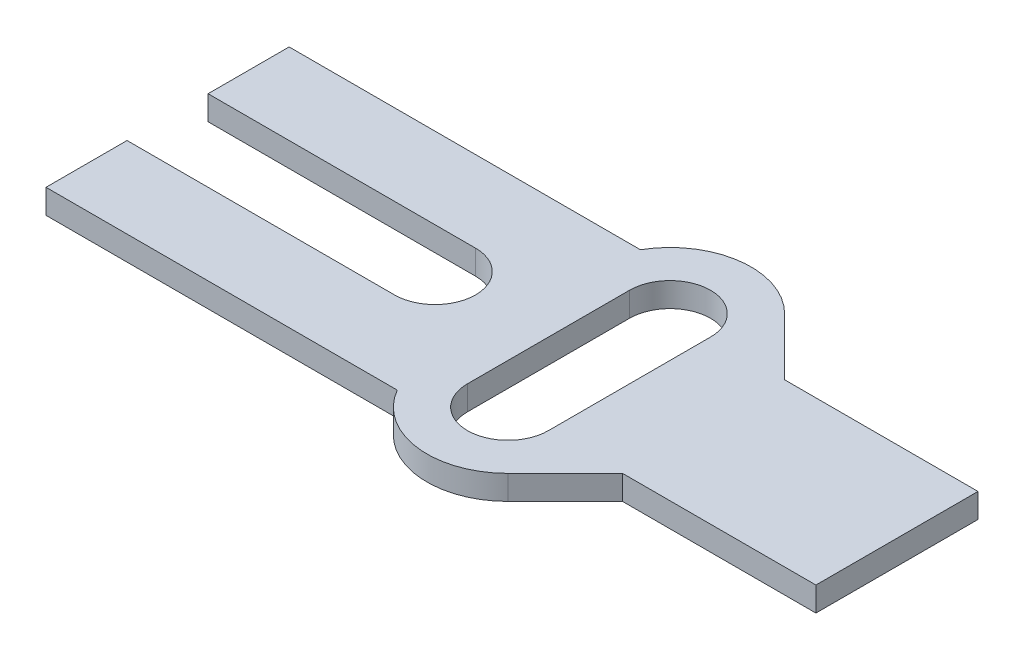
ISO-10303-21;
HEADER;
FILE_DESCRIPTION(('STEP AP214'),'2;1');
FILE_NAME('part.step','',(''),(''),'','','');
FILE_SCHEMA(('AUTOMOTIVE_DESIGN { 1 0 10303 214 1 1 1 1 }'));
ENDSEC;
DATA;
#1=APPLICATION_CONTEXT('core data for automotive mechanical design processes');
#2=APPLICATION_PROTOCOL_DEFINITION('international standard','automotive_design',2000,#1);
#3=PRODUCT_CONTEXT('',#1,'mechanical');
#4=PRODUCT('Part','Part','',(#3));
#5=PRODUCT_RELATED_PRODUCT_CATEGORY('part','',(#4));
#6=PRODUCT_DEFINITION_FORMATION('','',#4);
#7=PRODUCT_DEFINITION_CONTEXT('part definition',#1,'design');
#8=PRODUCT_DEFINITION('design','',#6,#7);
#9=PRODUCT_DEFINITION_SHAPE('','',#8);
#10=(LENGTH_UNIT() NAMED_UNIT(*) SI_UNIT(.MILLI.,.METRE.));
#11=(NAMED_UNIT(*) PLANE_ANGLE_UNIT() SI_UNIT($,.RADIAN.));
#12=(NAMED_UNIT(*) SI_UNIT($,.STERADIAN.) SOLID_ANGLE_UNIT());
#13=UNCERTAINTY_MEASURE_WITH_UNIT(LENGTH_MEASURE(1.E-05),#10,'distance_accuracy_value','');
#14=(GEOMETRIC_REPRESENTATION_CONTEXT(3) GLOBAL_UNCERTAINTY_ASSIGNED_CONTEXT((#13)) GLOBAL_UNIT_ASSIGNED_CONTEXT((#10,
#11,#12)) REPRESENTATION_CONTEXT('',''));
#15=CARTESIAN_POINT('',(0.,0.,0.));
#16=DIRECTION('',(0.,0.,1.));
#17=DIRECTION('',(1.,0.,0.));
#18=AXIS2_PLACEMENT_3D('',#15,#16,#17);
#19=CARTESIAN_POINT('',(33.,3.,-15.));
#20=DIRECTION('',(0.,1.,0.));
#21=DIRECTION('',(0.,0.,1.));
#22=AXIS2_PLACEMENT_3D('',#19,#20,#21);
#23=PLANE('',#22);
#24=DIRECTION('',(0.,0.,1.));
#25=VECTOR('',#24,1.);
#26=CARTESIAN_POINT('',(0.,3.,0.));
#27=LINE('',#26,#25);
#28=CARTESIAN_POINT('',(0.,3.,-10.));
#29=VERTEX_POINT('',#28);
#30=CARTESIAN_POINT('',(0.,3.,0.));
#31=VERTEX_POINT('',#30);
#32=EDGE_CURVE('E219',#29,#31,#27,.T.);
#33=ORIENTED_EDGE('',*,*,#32,.T.);
#34=DIRECTION('',(1.,0.,0.));
#35=VECTOR('',#34,1.);
#36=CARTESIAN_POINT('',(0.,3.,0.));
#37=LINE('',#36,#35);
#38=CARTESIAN_POINT('',(43.3397459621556,3.,0.));
#39=VERTEX_POINT('',#38);
#40=EDGE_CURVE('E222',#31,#39,#37,.T.);
#41=ORIENTED_EDGE('',*,*,#40,.T.);
#42=CARTESIAN_POINT('',(52.,3.,-5.));
#43=DIRECTION('',(0.,1.,0.));
#44=DIRECTION('',(0.,0.,1.));
#45=AXIS2_PLACEMENT_3D('',#42,#43,#44);
#46=CIRCLE('',#45,10.);
#47=CARTESIAN_POINT('',(59.0710678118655,3.,2.07106781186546));
#48=VERTEX_POINT('',#47);
#49=EDGE_CURVE('E224',#39,#48,#46,.T.);
#50=ORIENTED_EDGE('',*,*,#49,.T.);
#51=DIRECTION('',(0.707106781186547,0.,-0.707106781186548));
#52=VECTOR('',#51,1.);
#53=CARTESIAN_POINT('',(59.0710678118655,3.,2.07106781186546));
#54=LINE('',#53,#52);
#55=CARTESIAN_POINT('',(66.1421356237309,3.,-5.));
#56=VERTEX_POINT('',#55);
#57=EDGE_CURVE('E226',#48,#56,#54,.T.);
#58=ORIENTED_EDGE('',*,*,#57,.T.);
#59=DIRECTION('',(1.,0.,0.));
#60=VECTOR('',#59,1.);
#61=CARTESIAN_POINT('',(66.1421356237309,3.,-5.));
#62=LINE('',#61,#60);
#63=CARTESIAN_POINT('',(90.,3.,-5.));
#64=VERTEX_POINT('',#63);
#65=EDGE_CURVE('E228',#56,#64,#62,.T.);
#66=ORIENTED_EDGE('',*,*,#65,.T.);
#67=DIRECTION('',(0.,0.,-1.));
#68=VECTOR('',#67,1.);
#69=CARTESIAN_POINT('',(90.,3.,-5.));
#70=LINE('',#69,#68);
#71=CARTESIAN_POINT('',(90.,3.,-25.));
#72=VERTEX_POINT('',#71);
#73=EDGE_CURVE('E230',#64,#72,#70,.T.);
#74=ORIENTED_EDGE('',*,*,#73,.T.);
#75=DIRECTION('',(-1.,0.,0.));
#76=VECTOR('',#75,1.);
#77=CARTESIAN_POINT('',(66.1421356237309,3.,-25.));
#78=LINE('',#77,#76);
#79=CARTESIAN_POINT('',(66.1421356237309,3.,-25.));
#80=VERTEX_POINT('',#79);
#81=EDGE_CURVE('E232',#72,#80,#78,.T.);
#82=ORIENTED_EDGE('',*,*,#81,.T.);
#83=DIRECTION('',(-0.707106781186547,0.,-0.707106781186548));
#84=VECTOR('',#83,1.);
#85=CARTESIAN_POINT('',(59.0710678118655,3.,-32.0710678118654));
#86=LINE('',#85,#84);
#87=CARTESIAN_POINT('',(59.0710678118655,3.,-32.0710678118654));
#88=VERTEX_POINT('',#87);
#89=EDGE_CURVE('E234',#80,#88,#86,.T.);
#90=ORIENTED_EDGE('',*,*,#89,.T.);
#91=CARTESIAN_POINT('',(52.,3.,-25.));
#92=DIRECTION('',(0.,1.,0.));
#93=DIRECTION('',(0.,0.,1.));
#94=AXIS2_PLACEMENT_3D('',#91,#92,#93);
#95=CIRCLE('',#94,9.99999999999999);
#96=CARTESIAN_POINT('',(43.3397459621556,3.,-30.));
#97=VERTEX_POINT('',#96);
#98=EDGE_CURVE('E236',#88,#97,#95,.T.);
#99=ORIENTED_EDGE('',*,*,#98,.T.);
#100=DIRECTION('',(-1.,0.,0.));
#101=VECTOR('',#100,1.);
#102=CARTESIAN_POINT('',(0.,3.,-30.));
#103=LINE('',#102,#101);
#104=CARTESIAN_POINT('',(0.,3.,-30.));
#105=VERTEX_POINT('',#104);
#106=EDGE_CURVE('E238',#97,#105,#103,.T.);
#107=ORIENTED_EDGE('',*,*,#106,.T.);
#108=DIRECTION('',(0.,0.,1.));
#109=VECTOR('',#108,1.);
#110=CARTESIAN_POINT('',(0.,3.,-20.));
#111=LINE('',#110,#109);
#112=CARTESIAN_POINT('',(0.,3.,-20.));
#113=VERTEX_POINT('',#112);
#114=EDGE_CURVE('E240',#105,#113,#111,.T.);
#115=ORIENTED_EDGE('',*,*,#114,.T.);
#116=DIRECTION('',(1.,0.,0.));
#117=VECTOR('',#116,1.);
#118=CARTESIAN_POINT('',(0.,3.,-20.));
#119=LINE('',#118,#117);
#120=CARTESIAN_POINT('',(33.,3.,-20.));
#121=VERTEX_POINT('',#120);
#122=EDGE_CURVE('E242',#113,#121,#119,.T.);
#123=ORIENTED_EDGE('',*,*,#122,.T.);
#124=CARTESIAN_POINT('',(33.,3.,-15.));
#125=DIRECTION('',(0.,-1.,0.));
#126=DIRECTION('',(0.,0.,1.));
#127=AXIS2_PLACEMENT_3D('',#124,#125,#126);
#128=CIRCLE('',#127,5.);
#129=CARTESIAN_POINT('',(33.,3.,-10.));
#130=VERTEX_POINT('',#129);
#131=EDGE_CURVE('E244',#121,#130,#128,.T.);
#132=ORIENTED_EDGE('',*,*,#131,.T.);
#133=DIRECTION('',(-1.,0.,0.));
#134=VECTOR('',#133,1.);
#135=CARTESIAN_POINT('',(0.,3.,-10.));
#136=LINE('',#135,#134);
#137=EDGE_CURVE('E246',#130,#29,#136,.T.);
#138=ORIENTED_EDGE('',*,*,#137,.T.);
#139=EDGE_LOOP('',(#33,#41,#50,#58,#66,#74,#82,#90,#99,#107,#115,#123,#132,#138));
#140=FACE_BOUND('',#139,.T.);
#141=DIRECTION('',(0.,0.,1.));
#142=VECTOR('',#141,1.);
#143=CARTESIAN_POINT('',(47.,3.,-25.));
#144=LINE('',#143,#142);
#145=CARTESIAN_POINT('',(47.,3.,-25.));
#146=VERTEX_POINT('',#145);
#147=CARTESIAN_POINT('',(47.,3.,-5.));
#148=VERTEX_POINT('',#147);
#149=EDGE_CURVE('E181',#146,#148,#144,.T.);
#150=ORIENTED_EDGE('',*,*,#149,.F.);
#151=CARTESIAN_POINT('',(52.,3.,-25.));
#152=DIRECTION('',(0.,1.,0.));
#153=DIRECTION('',(0.,0.,1.));
#154=AXIS2_PLACEMENT_3D('',#151,#152,#153);
#155=CIRCLE('',#154,5.);
#156=CARTESIAN_POINT('',(57.,3.,-25.));
#157=VERTEX_POINT('',#156);
#158=EDGE_CURVE('E170',#157,#146,#155,.T.);
#159=ORIENTED_EDGE('',*,*,#158,.F.);
#160=DIRECTION('',(0.,0.,-1.));
#161=VECTOR('',#160,1.);
#162=CARTESIAN_POINT('',(57.,3.,-25.));
#163=LINE('',#162,#161);
#164=CARTESIAN_POINT('',(57.,3.,-5.));
#165=VERTEX_POINT('',#164);
#166=EDGE_CURVE('E185',#165,#157,#163,.T.);
#167=ORIENTED_EDGE('',*,*,#166,.F.);
#168=CARTESIAN_POINT('',(52.,3.,-5.));
#169=DIRECTION('',(0.,1.,0.));
#170=DIRECTION('',(0.,0.,1.));
#171=AXIS2_PLACEMENT_3D('',#168,#169,#170);
#172=CIRCLE('',#171,5.);
#173=EDGE_CURVE('E183',#148,#165,#172,.T.);
#174=ORIENTED_EDGE('',*,*,#173,.F.);
#175=EDGE_LOOP('',(#150,#159,#167,#174));
#176=FACE_BOUND('',#175,.T.);
#177=ADVANCED_FACE('F30',(#140,#176),#23,.T.);
#178=CARTESIAN_POINT('',(33.,0.,-15.));
#179=DIRECTION('',(0.,1.,0.));
#180=DIRECTION('',(0.,0.,1.));
#181=AXIS2_PLACEMENT_3D('',#178,#179,#180);
#182=PLANE('',#181);
#183=DIRECTION('',(0.,0.,1.));
#184=VECTOR('',#183,1.);
#185=CARTESIAN_POINT('',(0.,0.,0.));
#186=LINE('',#185,#184);
#187=CARTESIAN_POINT('',(0.,0.,-10.));
#188=VERTEX_POINT('',#187);
#189=CARTESIAN_POINT('',(0.,0.,0.));
#190=VERTEX_POINT('',#189);
#191=EDGE_CURVE('E171',#188,#190,#186,.T.);
#192=ORIENTED_EDGE('',*,*,#191,.F.);
#193=DIRECTION('',(-1.,0.,0.));
#194=VECTOR('',#193,1.);
#195=CARTESIAN_POINT('',(0.,0.,-10.));
#196=LINE('',#195,#194);
#197=CARTESIAN_POINT('',(33.,0.,-10.));
#198=VERTEX_POINT('',#197);
#199=EDGE_CURVE('E217',#198,#188,#196,.T.);
#200=ORIENTED_EDGE('',*,*,#199,.F.);
#201=CARTESIAN_POINT('',(33.,0.,-15.));
#202=DIRECTION('',(0.,-1.,0.));
#203=DIRECTION('',(0.,0.,1.));
#204=AXIS2_PLACEMENT_3D('',#201,#202,#203);
#205=CIRCLE('',#204,5.);
#206=CARTESIAN_POINT('',(33.,0.,-20.));
#207=VERTEX_POINT('',#206);
#208=EDGE_CURVE('E215',#207,#198,#205,.T.);
#209=ORIENTED_EDGE('',*,*,#208,.F.);
#210=DIRECTION('',(1.,0.,0.));
#211=VECTOR('',#210,1.);
#212=CARTESIAN_POINT('',(0.,0.,-20.));
#213=LINE('',#212,#211);
#214=CARTESIAN_POINT('',(0.,0.,-20.));
#215=VERTEX_POINT('',#214);
#216=EDGE_CURVE('E213',#215,#207,#213,.T.);
#217=ORIENTED_EDGE('',*,*,#216,.F.);
#218=DIRECTION('',(0.,0.,1.));
#219=VECTOR('',#218,1.);
#220=CARTESIAN_POINT('',(0.,0.,-20.));
#221=LINE('',#220,#219);
#222=CARTESIAN_POINT('',(0.,0.,-30.));
#223=VERTEX_POINT('',#222);
#224=EDGE_CURVE('E211',#223,#215,#221,.T.);
#225=ORIENTED_EDGE('',*,*,#224,.F.);
#226=DIRECTION('',(-1.,0.,0.));
#227=VECTOR('',#226,1.);
#228=CARTESIAN_POINT('',(0.,0.,-30.));
#229=LINE('',#228,#227);
#230=CARTESIAN_POINT('',(43.3397459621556,0.,-30.));
#231=VERTEX_POINT('',#230);
#232=EDGE_CURVE('E209',#231,#223,#229,.T.);
#233=ORIENTED_EDGE('',*,*,#232,.F.);
#234=CARTESIAN_POINT('',(52.,0.,-25.));
#235=DIRECTION('',(0.,1.,0.));
#236=DIRECTION('',(0.,0.,1.));
#237=AXIS2_PLACEMENT_3D('',#234,#235,#236);
#238=CIRCLE('',#237,9.99999999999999);
#239=CARTESIAN_POINT('',(59.0710678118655,0.,-32.0710678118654));
#240=VERTEX_POINT('',#239);
#241=EDGE_CURVE('E207',#240,#231,#238,.T.);
#242=ORIENTED_EDGE('',*,*,#241,.F.);
#243=DIRECTION('',(-0.707106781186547,0.,-0.707106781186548));
#244=VECTOR('',#243,1.);
#245=CARTESIAN_POINT('',(59.0710678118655,0.,-32.0710678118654));
#246=LINE('',#245,#244);
#247=CARTESIAN_POINT('',(66.1421356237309,0.,-25.));
#248=VERTEX_POINT('',#247);
#249=EDGE_CURVE('E205',#248,#240,#246,.T.);
#250=ORIENTED_EDGE('',*,*,#249,.F.);
#251=DIRECTION('',(-1.,0.,0.));
#252=VECTOR('',#251,1.);
#253=CARTESIAN_POINT('',(66.1421356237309,0.,-25.));
#254=LINE('',#253,#252);
#255=CARTESIAN_POINT('',(90.,0.,-25.));
#256=VERTEX_POINT('',#255);
#257=EDGE_CURVE('E203',#256,#248,#254,.T.);
#258=ORIENTED_EDGE('',*,*,#257,.F.);
#259=DIRECTION('',(0.,0.,-1.));
#260=VECTOR('',#259,1.);
#261=CARTESIAN_POINT('',(90.,0.,-5.));
#262=LINE('',#261,#260);
#263=CARTESIAN_POINT('',(90.,0.,-5.));
#264=VERTEX_POINT('',#263);
#265=EDGE_CURVE('E201',#264,#256,#262,.T.);
#266=ORIENTED_EDGE('',*,*,#265,.F.);
#267=DIRECTION('',(1.,0.,0.));
#268=VECTOR('',#267,1.);
#269=CARTESIAN_POINT('',(66.1421356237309,0.,-5.));
#270=LINE('',#269,#268);
#271=CARTESIAN_POINT('',(66.1421356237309,0.,-5.));
#272=VERTEX_POINT('',#271);
#273=EDGE_CURVE('E199',#272,#264,#270,.T.);
#274=ORIENTED_EDGE('',*,*,#273,.F.);
#275=DIRECTION('',(0.707106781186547,0.,-0.707106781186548));
#276=VECTOR('',#275,1.);
#277=CARTESIAN_POINT('',(59.0710678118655,0.,2.07106781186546));
#278=LINE('',#277,#276);
#279=CARTESIAN_POINT('',(59.0710678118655,0.,2.07106781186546));
#280=VERTEX_POINT('',#279);
#281=EDGE_CURVE('E197',#280,#272,#278,.T.);
#282=ORIENTED_EDGE('',*,*,#281,.F.);
#283=CARTESIAN_POINT('',(52.,0.,-5.));
#284=DIRECTION('',(0.,1.,0.));
#285=DIRECTION('',(0.,0.,1.));
#286=AXIS2_PLACEMENT_3D('',#283,#284,#285);
#287=CIRCLE('',#286,10.);
#288=CARTESIAN_POINT('',(43.3397459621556,0.,0.));
#289=VERTEX_POINT('',#288);
#290=EDGE_CURVE('E195',#289,#280,#287,.T.);
#291=ORIENTED_EDGE('',*,*,#290,.F.);
#292=DIRECTION('',(1.,0.,0.));
#293=VECTOR('',#292,1.);
#294=CARTESIAN_POINT('',(0.,0.,0.));
#295=LINE('',#294,#293);
#296=EDGE_CURVE('E193',#190,#289,#295,.T.);
#297=ORIENTED_EDGE('',*,*,#296,.F.);
#298=EDGE_LOOP('',(#192,#200,#209,#217,#225,#233,#242,#250,#258,#266,#274,#282,#291,#297));
#299=FACE_BOUND('',#298,.T.);
#300=CARTESIAN_POINT('',(52.,0.,-25.));
#301=DIRECTION('',(0.,1.,0.));
#302=DIRECTION('',(0.,0.,1.));
#303=AXIS2_PLACEMENT_3D('',#300,#301,#302);
#304=CIRCLE('',#303,5.);
#305=CARTESIAN_POINT('',(57.,0.,-25.));
#306=VERTEX_POINT('',#305);
#307=CARTESIAN_POINT('',(47.,0.,-25.));
#308=VERTEX_POINT('',#307);
#309=EDGE_CURVE('E53',#306,#308,#304,.T.);
#310=ORIENTED_EDGE('',*,*,#309,.T.);
#311=DIRECTION('',(0.,0.,1.));
#312=VECTOR('',#311,1.);
#313=CARTESIAN_POINT('',(47.,0.,-25.));
#314=LINE('',#313,#312);
#315=CARTESIAN_POINT('',(47.,0.,-5.));
#316=VERTEX_POINT('',#315);
#317=EDGE_CURVE('E157',#308,#316,#314,.T.);
#318=ORIENTED_EDGE('',*,*,#317,.T.);
#319=CARTESIAN_POINT('',(52.,0.,-5.));
#320=DIRECTION('',(0.,1.,0.));
#321=DIRECTION('',(0.,0.,1.));
#322=AXIS2_PLACEMENT_3D('',#319,#320,#321);
#323=CIRCLE('',#322,5.);
#324=CARTESIAN_POINT('',(57.,0.,-5.));
#325=VERTEX_POINT('',#324);
#326=EDGE_CURVE('E166',#316,#325,#323,.T.);
#327=ORIENTED_EDGE('',*,*,#326,.T.);
#328=DIRECTION('',(0.,0.,-1.));
#329=VECTOR('',#328,1.);
#330=CARTESIAN_POINT('',(57.,0.,-25.));
#331=LINE('',#330,#329);
#332=EDGE_CURVE('E175',#325,#306,#331,.T.);
#333=ORIENTED_EDGE('',*,*,#332,.T.);
#334=EDGE_LOOP('',(#310,#318,#327,#333));
#335=FACE_BOUND('',#334,.T.);
#336=ADVANCED_FACE('F174',(#299,#335),#182,.F.);
#337=CARTESIAN_POINT('',(0.,3.,0.));
#338=DIRECTION('',(1.,0.,0.));
#339=DIRECTION('',(0.,0.,-1.));
#340=AXIS2_PLACEMENT_3D('',#337,#338,#339);
#341=PLANE('',#340);
#342=ORIENTED_EDGE('',*,*,#191,.T.);
#343=DIRECTION('',(0.,-1.,0.));
#344=VECTOR('',#343,1.);
#345=CARTESIAN_POINT('',(0.,3.,0.));
#346=LINE('',#345,#344);
#347=EDGE_CURVE('E11',#31,#190,#346,.T.);
#348=ORIENTED_EDGE('',*,*,#347,.F.);
#349=ORIENTED_EDGE('',*,*,#32,.F.);
#350=DIRECTION('',(0.,-1.,0.));
#351=VECTOR('',#350,1.);
#352=CARTESIAN_POINT('',(0.,3.,-10.));
#353=LINE('',#352,#351);
#354=EDGE_CURVE('E248',#29,#188,#353,.T.);
#355=ORIENTED_EDGE('',*,*,#354,.T.);
#356=EDGE_LOOP('',(#342,#348,#349,#355));
#357=FACE_BOUND('',#356,.T.);
#358=ADVANCED_FACE('F32',(#357),#341,.F.);
#359=CARTESIAN_POINT('',(0.,3.,0.));
#360=DIRECTION('',(0.,0.,-1.));
#361=DIRECTION('',(-1.,0.,0.));
#362=AXIS2_PLACEMENT_3D('',#359,#360,#361);
#363=PLANE('',#362);
#364=ORIENTED_EDGE('',*,*,#296,.T.);
#365=DIRECTION('',(0.,-1.,0.));
#366=VECTOR('',#365,1.);
#367=CARTESIAN_POINT('',(43.3397459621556,3.,0.));
#368=LINE('',#367,#366);
#369=EDGE_CURVE('E38',#39,#289,#368,.T.);
#370=ORIENTED_EDGE('',*,*,#369,.F.);
#371=ORIENTED_EDGE('',*,*,#40,.F.);
#372=ORIENTED_EDGE('',*,*,#347,.T.);
#373=EDGE_LOOP('',(#364,#370,#371,#372));
#374=FACE_BOUND('',#373,.T.);
#375=ADVANCED_FACE('F310',(#374),#363,.F.);
#376=CARTESIAN_POINT('',(52.,3.,-5.));
#377=DIRECTION('',(0.,-1.,0.));
#378=DIRECTION('',(0.,0.,-1.));
#379=AXIS2_PLACEMENT_3D('',#376,#377,#378);
#380=CYLINDRICAL_SURFACE('',#379,10.);
#381=ORIENTED_EDGE('',*,*,#290,.T.);
#382=DIRECTION('',(0.,-1.,0.));
#383=VECTOR('',#382,1.);
#384=CARTESIAN_POINT('',(59.0710678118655,3.,2.07106781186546));
#385=LINE('',#384,#383);
#386=EDGE_CURVE('E281',#48,#280,#385,.T.);
#387=ORIENTED_EDGE('',*,*,#386,.F.);
#388=ORIENTED_EDGE('',*,*,#49,.F.);
#389=ORIENTED_EDGE('',*,*,#369,.T.);
#390=EDGE_LOOP('',(#381,#387,#388,#389));
#391=FACE_BOUND('',#390,.T.);
#392=ADVANCED_FACE('F288',(#391),#380,.T.);
#393=CARTESIAN_POINT('',(59.0710678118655,3.,2.07106781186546));
#394=DIRECTION('',(-0.707106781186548,0.,-0.707106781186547));
#395=DIRECTION('',(-0.707106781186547,0.,0.707106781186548));
#396=AXIS2_PLACEMENT_3D('',#393,#394,#395);
#397=PLANE('',#396);
#398=ORIENTED_EDGE('',*,*,#281,.T.);
#399=DIRECTION('',(0.,-1.,0.));
#400=VECTOR('',#399,1.);
#401=CARTESIAN_POINT('',(66.1421356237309,3.,-5.));
#402=LINE('',#401,#400);
#403=EDGE_CURVE('E278',#56,#272,#402,.T.);
#404=ORIENTED_EDGE('',*,*,#403,.F.);
#405=ORIENTED_EDGE('',*,*,#57,.F.);
#406=ORIENTED_EDGE('',*,*,#386,.T.);
#407=EDGE_LOOP('',(#398,#404,#405,#406));
#408=FACE_BOUND('',#407,.T.);
#409=ADVANCED_FACE('F298',(#408),#397,.F.);
#410=CARTESIAN_POINT('',(66.1421356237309,3.,-5.));
#411=DIRECTION('',(0.,0.,-1.));
#412=DIRECTION('',(-1.,0.,0.));
#413=AXIS2_PLACEMENT_3D('',#410,#411,#412);
#414=PLANE('',#413);
#415=ORIENTED_EDGE('',*,*,#273,.T.);
#416=DIRECTION('',(0.,-1.,0.));
#417=VECTOR('',#416,1.);
#418=CARTESIAN_POINT('',(90.,3.,-5.));
#419=LINE('',#418,#417);
#420=EDGE_CURVE('E275',#64,#264,#419,.T.);
#421=ORIENTED_EDGE('',*,*,#420,.F.);
#422=ORIENTED_EDGE('',*,*,#65,.F.);
#423=ORIENTED_EDGE('',*,*,#403,.T.);
#424=EDGE_LOOP('',(#415,#421,#422,#423));
#425=FACE_BOUND('',#424,.T.);
#426=ADVANCED_FACE('F302',(#425),#414,.F.);
#427=CARTESIAN_POINT('',(90.,3.,-5.));
#428=DIRECTION('',(-1.,0.,0.));
#429=DIRECTION('',(0.,0.,1.));
#430=AXIS2_PLACEMENT_3D('',#427,#428,#429);
#431=PLANE('',#430);
#432=ORIENTED_EDGE('',*,*,#265,.T.);
#433=DIRECTION('',(0.,-1.,0.));
#434=VECTOR('',#433,1.);
#435=CARTESIAN_POINT('',(90.,3.,-25.));
#436=LINE('',#435,#434);
#437=EDGE_CURVE('E272',#72,#256,#436,.T.);
#438=ORIENTED_EDGE('',*,*,#437,.F.);
#439=ORIENTED_EDGE('',*,*,#73,.F.);
#440=ORIENTED_EDGE('',*,*,#420,.T.);
#441=EDGE_LOOP('',(#432,#438,#439,#440));
#442=FACE_BOUND('',#441,.T.);
#443=ADVANCED_FACE('F353',(#442),#431,.F.);
#444=CARTESIAN_POINT('',(66.1421356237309,3.,-25.));
#445=DIRECTION('',(0.,0.,1.));
#446=DIRECTION('',(1.,0.,0.));
#447=AXIS2_PLACEMENT_3D('',#444,#445,#446);
#448=PLANE('',#447);
#449=ORIENTED_EDGE('',*,*,#257,.T.);
#450=DIRECTION('',(0.,-1.,0.));
#451=VECTOR('',#450,1.);
#452=CARTESIAN_POINT('',(66.1421356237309,3.,-25.));
#453=LINE('',#452,#451);
#454=EDGE_CURVE('E269',#80,#248,#453,.T.);
#455=ORIENTED_EDGE('',*,*,#454,.F.);
#456=ORIENTED_EDGE('',*,*,#81,.F.);
#457=ORIENTED_EDGE('',*,*,#437,.T.);
#458=EDGE_LOOP('',(#449,#455,#456,#457));
#459=FACE_BOUND('',#458,.T.);
#460=ADVANCED_FACE('F351',(#459),#448,.F.);
#461=CARTESIAN_POINT('',(59.0710678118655,3.,-32.0710678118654));
#462=DIRECTION('',(-0.707106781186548,0.,0.707106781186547));
#463=DIRECTION('',(0.707106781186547,0.,0.707106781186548));
#464=AXIS2_PLACEMENT_3D('',#461,#462,#463);
#465=PLANE('',#464);
#466=ORIENTED_EDGE('',*,*,#249,.T.);
#467=DIRECTION('',(0.,-1.,0.));
#468=VECTOR('',#467,1.);
#469=CARTESIAN_POINT('',(59.0710678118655,3.,-32.0710678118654));
#470=LINE('',#469,#468);
#471=EDGE_CURVE('E266',#88,#240,#470,.T.);
#472=ORIENTED_EDGE('',*,*,#471,.F.);
#473=ORIENTED_EDGE('',*,*,#89,.F.);
#474=ORIENTED_EDGE('',*,*,#454,.T.);
#475=EDGE_LOOP('',(#466,#472,#473,#474));
#476=FACE_BOUND('',#475,.T.);
#477=ADVANCED_FACE('F346',(#476),#465,.F.);
#478=CARTESIAN_POINT('',(52.,3.,-25.));
#479=DIRECTION('',(0.,-1.,0.));
#480=DIRECTION('',(0.,0.,-1.));
#481=AXIS2_PLACEMENT_3D('',#478,#479,#480);
#482=CYLINDRICAL_SURFACE('',#481,9.99999999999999);
#483=ORIENTED_EDGE('',*,*,#241,.T.);
#484=DIRECTION('',(0.,-1.,0.));
#485=VECTOR('',#484,1.);
#486=CARTESIAN_POINT('',(43.3397459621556,3.,-30.));
#487=LINE('',#486,#485);
#488=EDGE_CURVE('E263',#97,#231,#487,.T.);
#489=ORIENTED_EDGE('',*,*,#488,.F.);
#490=ORIENTED_EDGE('',*,*,#98,.F.);
#491=ORIENTED_EDGE('',*,*,#471,.T.);
#492=EDGE_LOOP('',(#483,#489,#490,#491));
#493=FACE_BOUND('',#492,.T.);
#494=ADVANCED_FACE('F341',(#493),#482,.T.);
#495=CARTESIAN_POINT('',(0.,3.,-30.));
#496=DIRECTION('',(0.,0.,1.));
#497=DIRECTION('',(1.,0.,0.));
#498=AXIS2_PLACEMENT_3D('',#495,#496,#497);
#499=PLANE('',#498);
#500=ORIENTED_EDGE('',*,*,#232,.T.);
#501=DIRECTION('',(0.,-1.,0.));
#502=VECTOR('',#501,1.);
#503=CARTESIAN_POINT('',(0.,3.,-30.));
#504=LINE('',#503,#502);
#505=EDGE_CURVE('E260',#105,#223,#504,.T.);
#506=ORIENTED_EDGE('',*,*,#505,.F.);
#507=ORIENTED_EDGE('',*,*,#106,.F.);
#508=ORIENTED_EDGE('',*,*,#488,.T.);
#509=EDGE_LOOP('',(#500,#506,#507,#508));
#510=FACE_BOUND('',#509,.T.);
#511=ADVANCED_FACE('F337',(#510),#499,.F.);
#512=CARTESIAN_POINT('',(0.,3.,-20.));
#513=DIRECTION('',(1.,0.,0.));
#514=DIRECTION('',(0.,0.,-1.));
#515=AXIS2_PLACEMENT_3D('',#512,#513,#514);
#516=PLANE('',#515);
#517=ORIENTED_EDGE('',*,*,#224,.T.);
#518=DIRECTION('',(0.,-1.,0.));
#519=VECTOR('',#518,1.);
#520=CARTESIAN_POINT('',(0.,3.,-20.));
#521=LINE('',#520,#519);
#522=EDGE_CURVE('E257',#113,#215,#521,.T.);
#523=ORIENTED_EDGE('',*,*,#522,.F.);
#524=ORIENTED_EDGE('',*,*,#114,.F.);
#525=ORIENTED_EDGE('',*,*,#505,.T.);
#526=EDGE_LOOP('',(#517,#523,#524,#525));
#527=FACE_BOUND('',#526,.T.);
#528=ADVANCED_FACE('F332',(#527),#516,.F.);
#529=CARTESIAN_POINT('',(0.,3.,-20.));
#530=DIRECTION('',(0.,0.,-1.));
#531=DIRECTION('',(-1.,0.,0.));
#532=AXIS2_PLACEMENT_3D('',#529,#530,#531);
#533=PLANE('',#532);
#534=ORIENTED_EDGE('',*,*,#216,.T.);
#535=DIRECTION('',(0.,-1.,0.));
#536=VECTOR('',#535,1.);
#537=CARTESIAN_POINT('',(33.,3.,-20.));
#538=LINE('',#537,#536);
#539=EDGE_CURVE('E254',#121,#207,#538,.T.);
#540=ORIENTED_EDGE('',*,*,#539,.F.);
#541=ORIENTED_EDGE('',*,*,#122,.F.);
#542=ORIENTED_EDGE('',*,*,#522,.T.);
#543=EDGE_LOOP('',(#534,#540,#541,#542));
#544=FACE_BOUND('',#543,.T.);
#545=ADVANCED_FACE('F326',(#544),#533,.F.);
#546=CARTESIAN_POINT('',(33.,3.,-15.));
#547=DIRECTION('',(0.,-1.,0.));
#548=DIRECTION('',(0.,0.,-1.));
#549=AXIS2_PLACEMENT_3D('',#546,#547,#548);
#550=CYLINDRICAL_SURFACE('',#549,5.);
#551=ORIENTED_EDGE('',*,*,#208,.T.);
#552=DIRECTION('',(0.,-1.,0.));
#553=VECTOR('',#552,1.);
#554=CARTESIAN_POINT('',(33.,3.,-10.));
#555=LINE('',#554,#553);
#556=EDGE_CURVE('E251',#130,#198,#555,.T.);
#557=ORIENTED_EDGE('',*,*,#556,.F.);
#558=ORIENTED_EDGE('',*,*,#131,.F.);
#559=ORIENTED_EDGE('',*,*,#539,.T.);
#560=EDGE_LOOP('',(#551,#557,#558,#559));
#561=FACE_BOUND('',#560,.T.);
#562=ADVANCED_FACE('F322',(#561),#550,.F.);
#563=CARTESIAN_POINT('',(0.,3.,-10.));
#564=DIRECTION('',(0.,0.,1.));
#565=DIRECTION('',(1.,0.,0.));
#566=AXIS2_PLACEMENT_3D('',#563,#564,#565);
#567=PLANE('',#566);
#568=ORIENTED_EDGE('',*,*,#199,.T.);
#569=ORIENTED_EDGE('',*,*,#354,.F.);
#570=ORIENTED_EDGE('',*,*,#137,.F.);
#571=ORIENTED_EDGE('',*,*,#556,.T.);
#572=EDGE_LOOP('',(#568,#569,#570,#571));
#573=FACE_BOUND('',#572,.T.);
#574=ADVANCED_FACE('F317',(#573),#567,.F.);
#575=CARTESIAN_POINT('',(52.,3.,-25.));
#576=DIRECTION('',(0.,-1.,0.));
#577=DIRECTION('',(0.,0.,-1.));
#578=AXIS2_PLACEMENT_3D('',#575,#576,#577);
#579=CYLINDRICAL_SURFACE('',#578,5.);
#580=ORIENTED_EDGE('',*,*,#309,.F.);
#581=DIRECTION('',(0.,-1.,0.));
#582=VECTOR('',#581,1.);
#583=CARTESIAN_POINT('',(57.,3.,-25.));
#584=LINE('',#583,#582);
#585=EDGE_CURVE('E187',#157,#306,#584,.T.);
#586=ORIENTED_EDGE('',*,*,#585,.F.);
#587=ORIENTED_EDGE('',*,*,#158,.T.);
#588=DIRECTION('',(0.,-1.,0.));
#589=VECTOR('',#588,1.);
#590=CARTESIAN_POINT('',(47.,3.,-25.));
#591=LINE('',#590,#589);
#592=EDGE_CURVE('E159',#146,#308,#591,.T.);
#593=ORIENTED_EDGE('',*,*,#592,.T.);
#594=EDGE_LOOP('',(#580,#586,#587,#593));
#595=FACE_BOUND('',#594,.T.);
#596=ADVANCED_FACE('F168',(#595),#579,.F.);
#597=CARTESIAN_POINT('',(47.,3.,-25.));
#598=DIRECTION('',(1.,0.,0.));
#599=DIRECTION('',(0.,0.,-1.));
#600=AXIS2_PLACEMENT_3D('',#597,#598,#599);
#601=PLANE('',#600);
#602=ORIENTED_EDGE('',*,*,#317,.F.);
#603=ORIENTED_EDGE('',*,*,#592,.F.);
#604=ORIENTED_EDGE('',*,*,#149,.T.);
#605=DIRECTION('',(0.,-1.,0.));
#606=VECTOR('',#605,1.);
#607=CARTESIAN_POINT('',(47.,3.,-5.));
#608=LINE('',#607,#606);
#609=EDGE_CURVE('E162',#148,#316,#608,.T.);
#610=ORIENTED_EDGE('',*,*,#609,.T.);
#611=EDGE_LOOP('',(#602,#603,#604,#610));
#612=FACE_BOUND('',#611,.T.);
#613=ADVANCED_FACE('F158',(#612),#601,.T.);
#614=CARTESIAN_POINT('',(52.,3.,-5.));
#615=DIRECTION('',(0.,-1.,0.));
#616=DIRECTION('',(0.,0.,-1.));
#617=AXIS2_PLACEMENT_3D('',#614,#615,#616);
#618=CYLINDRICAL_SURFACE('',#617,5.);
#619=ORIENTED_EDGE('',*,*,#326,.F.);
#620=ORIENTED_EDGE('',*,*,#609,.F.);
#621=ORIENTED_EDGE('',*,*,#173,.T.);
#622=DIRECTION('',(0.,-1.,0.));
#623=VECTOR('',#622,1.);
#624=CARTESIAN_POINT('',(57.,3.,-5.));
#625=LINE('',#624,#623);
#626=EDGE_CURVE('E45',#165,#325,#625,.T.);
#627=ORIENTED_EDGE('',*,*,#626,.T.);
#628=EDGE_LOOP('',(#619,#620,#621,#627));
#629=FACE_BOUND('',#628,.T.);
#630=ADVANCED_FACE('F422',(#629),#618,.F.);
#631=CARTESIAN_POINT('',(57.,3.,-25.));
#632=DIRECTION('',(-1.,0.,0.));
#633=DIRECTION('',(0.,0.,1.));
#634=AXIS2_PLACEMENT_3D('',#631,#632,#633);
#635=PLANE('',#634);
#636=ORIENTED_EDGE('',*,*,#332,.F.);
#637=ORIENTED_EDGE('',*,*,#626,.F.);
#638=ORIENTED_EDGE('',*,*,#166,.T.);
#639=ORIENTED_EDGE('',*,*,#585,.T.);
#640=EDGE_LOOP('',(#636,#637,#638,#639));
#641=FACE_BOUND('',#640,.T.);
#642=ADVANCED_FACE('F429',(#641),#635,.T.);
#643=CLOSED_SHELL('',(#177,#336,#358,#375,#392,#409,#426,#443,#460,#477,#494,#511,#528,#545,
#562,#574,#596,#613,#630,#642));
#644=MANIFOLD_SOLID_BREP('B2',#643);
#645=ADVANCED_BREP_SHAPE_REPRESENTATION('',(#18,#644),#14);
#646=SHAPE_DEFINITION_REPRESENTATION(#9,#645);
ENDSEC;
END-ISO-10303-21;
